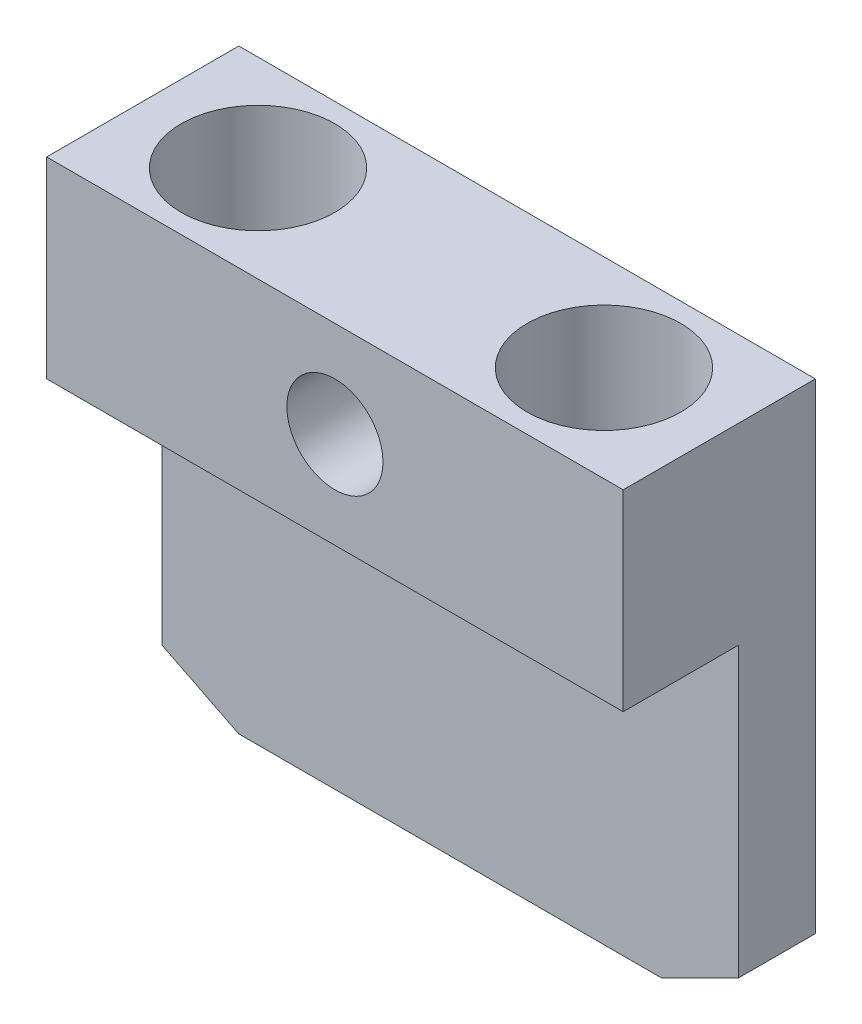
ISO-10303-21;
HEADER;
FILE_DESCRIPTION(('STEP AP214'),'2;1');
FILE_NAME('part.step','',(''),(''),'','','');
FILE_SCHEMA(('AUTOMOTIVE_DESIGN { 1 0 10303 214 1 1 1 1 }'));
ENDSEC;
DATA;
#1=APPLICATION_CONTEXT('core data for automotive mechanical design processes');
#2=APPLICATION_PROTOCOL_DEFINITION('international standard','automotive_design',2000,#1);
#3=PRODUCT_CONTEXT('',#1,'mechanical');
#4=PRODUCT('Part','Part','',(#3));
#5=PRODUCT_RELATED_PRODUCT_CATEGORY('part','',(#4));
#6=PRODUCT_DEFINITION_FORMATION('','',#4);
#7=PRODUCT_DEFINITION_CONTEXT('part definition',#1,'design');
#8=PRODUCT_DEFINITION('design','',#6,#7);
#9=PRODUCT_DEFINITION_SHAPE('','',#8);
#10=(LENGTH_UNIT() NAMED_UNIT(*) SI_UNIT(.MILLI.,.METRE.));
#11=(NAMED_UNIT(*) PLANE_ANGLE_UNIT() SI_UNIT($,.RADIAN.));
#12=(NAMED_UNIT(*) SI_UNIT($,.STERADIAN.) SOLID_ANGLE_UNIT());
#13=UNCERTAINTY_MEASURE_WITH_UNIT(LENGTH_MEASURE(1.E-05),#10,'distance_accuracy_value','');
#14=(GEOMETRIC_REPRESENTATION_CONTEXT(3) GLOBAL_UNCERTAINTY_ASSIGNED_CONTEXT((#13)) GLOBAL_UNIT_ASSIGNED_CONTEXT((#10,
#11,#12)) REPRESENTATION_CONTEXT('',''));
#15=CARTESIAN_POINT('',(0.,0.,0.));
#16=DIRECTION('',(0.,0.,1.));
#17=DIRECTION('',(1.,0.,0.));
#18=AXIS2_PLACEMENT_3D('',#15,#16,#17);
#19=CARTESIAN_POINT('',(0.,1.,5.));
#20=DIRECTION('',(0.,0.,-1.));
#21=DIRECTION('',(-1.,0.,0.));
#22=AXIS2_PLACEMENT_3D('',#19,#20,#21);
#23=PLANE('',#22);
#24=CARTESIAN_POINT('',(7.5,11.,5.));
#25=DIRECTION('',(0.,0.,1.));
#26=DIRECTION('',(1.,0.,0.));
#27=AXIS2_PLACEMENT_3D('',#24,#25,#26);
#28=CIRCLE('',#27,1.25);
#29=CARTESIAN_POINT('',(8.75,11.,5.));
#30=VERTEX_POINT('',#29);
#31=EDGE_CURVE('E146',#30,#30,#28,.T.);
#32=ORIENTED_EDGE('',*,*,#31,.F.);
#33=EDGE_LOOP('',(#32));
#34=FACE_BOUND('',#33,.T.);
#35=DIRECTION('',(-1.,0.,0.));
#36=VECTOR('',#35,1.);
#37=CARTESIAN_POINT('',(57.2382786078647,8.5,5.));
#38=LINE('',#37,#36);
#39=CARTESIAN_POINT('',(15.,8.5,5.));
#40=VERTEX_POINT('',#39);
#41=CARTESIAN_POINT('',(0.,8.5,5.));
#42=VERTEX_POINT('',#41);
#43=EDGE_CURVE('E115',#40,#42,#38,.T.);
#44=ORIENTED_EDGE('',*,*,#43,.F.);
#45=DIRECTION('',(0.,1.,0.));
#46=VECTOR('',#45,1.);
#47=CARTESIAN_POINT('',(15.,1.,5.));
#48=LINE('',#47,#46);
#49=CARTESIAN_POINT('',(15.,13.5,5.));
#50=VERTEX_POINT('',#49);
#51=EDGE_CURVE('E133',#40,#50,#48,.T.);
#52=ORIENTED_EDGE('',*,*,#51,.T.);
#53=DIRECTION('',(-1.,0.,0.));
#54=VECTOR('',#53,1.);
#55=CARTESIAN_POINT('',(0.,13.5,5.));
#56=LINE('',#55,#54);
#57=CARTESIAN_POINT('',(0.,13.5,5.));
#58=VERTEX_POINT('',#57);
#59=EDGE_CURVE('E149',#50,#58,#56,.T.);
#60=ORIENTED_EDGE('',*,*,#59,.T.);
#61=DIRECTION('',(0.,-1.,0.));
#62=VECTOR('',#61,1.);
#63=CARTESIAN_POINT('',(0.,1.,5.));
#64=LINE('',#63,#62);
#65=EDGE_CURVE('E108',#58,#42,#64,.T.);
#66=ORIENTED_EDGE('',*,*,#65,.T.);
#67=EDGE_LOOP('',(#44,#52,#60,#66));
#68=FACE_BOUND('',#67,.T.);
#69=ADVANCED_FACE('F32',(#34,#68),#23,.F.);
#70=CARTESIAN_POINT('',(2.,0.,5.));
#71=DIRECTION('',(0.447213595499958,0.894427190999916,0.));
#72=DIRECTION('',(-0.894427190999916,0.447213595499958,0.));
#73=AXIS2_PLACEMENT_3D('',#70,#71,#72);
#74=PLANE('',#73);
#75=DIRECTION('',(0.894427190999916,-0.447213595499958,0.));
#76=VECTOR('',#75,1.);
#77=CARTESIAN_POINT('',(2.,0.,2.));
#78=LINE('',#77,#76);
#79=CARTESIAN_POINT('',(0.,1.,2.));
#80=VERTEX_POINT('',#79);
#81=CARTESIAN_POINT('',(2.,0.,2.));
#82=VERTEX_POINT('',#81);
#83=EDGE_CURVE('E111',#80,#82,#78,.T.);
#84=ORIENTED_EDGE('',*,*,#83,.F.);
#85=DIRECTION('',(0.,0.,-1.));
#86=VECTOR('',#85,1.);
#87=CARTESIAN_POINT('',(0.,1.,5.));
#88=LINE('',#87,#86);
#89=CARTESIAN_POINT('',(0.,1.,0.));
#90=VERTEX_POINT('',#89);
#91=EDGE_CURVE('E97',#80,#90,#88,.T.);
#92=ORIENTED_EDGE('',*,*,#91,.T.);
#93=DIRECTION('',(0.894427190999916,-0.447213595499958,0.));
#94=VECTOR('',#93,1.);
#95=CARTESIAN_POINT('',(2.,0.,0.));
#96=LINE('',#95,#94);
#97=CARTESIAN_POINT('',(2.,0.,0.));
#98=VERTEX_POINT('',#97);
#99=EDGE_CURVE('E144',#90,#98,#96,.T.);
#100=ORIENTED_EDGE('',*,*,#99,.T.);
#101=DIRECTION('',(0.,0.,-1.));
#102=VECTOR('',#101,1.);
#103=CARTESIAN_POINT('',(2.,0.,5.));
#104=LINE('',#103,#102);
#105=EDGE_CURVE('E112',#82,#98,#104,.T.);
#106=ORIENTED_EDGE('',*,*,#105,.F.);
#107=EDGE_LOOP('',(#84,#92,#100,#106));
#108=FACE_BOUND('',#107,.T.);
#109=ADVANCED_FACE('F34',(#108),#74,.F.);
#110=CARTESIAN_POINT('',(2.,0.,5.));
#111=DIRECTION('',(0.,1.,0.));
#112=DIRECTION('',(0.,0.,1.));
#113=AXIS2_PLACEMENT_3D('',#110,#111,#112);
#114=PLANE('',#113);
#115=DIRECTION('',(-1.,0.,0.));
#116=VECTOR('',#115,1.);
#117=CARTESIAN_POINT('',(57.2382786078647,0.,2.));
#118=LINE('',#117,#116);
#119=CARTESIAN_POINT('',(13.,0.,2.));
#120=VERTEX_POINT('',#119);
#121=EDGE_CURVE('E47',#120,#82,#118,.T.);
#122=ORIENTED_EDGE('',*,*,#121,.T.);
#123=ORIENTED_EDGE('',*,*,#105,.T.);
#124=DIRECTION('',(1.,0.,0.));
#125=VECTOR('',#124,1.);
#126=CARTESIAN_POINT('',(2.,0.,0.));
#127=LINE('',#126,#125);
#128=CARTESIAN_POINT('',(13.,0.,0.));
#129=VERTEX_POINT('',#128);
#130=EDGE_CURVE('E141',#98,#129,#127,.T.);
#131=ORIENTED_EDGE('',*,*,#130,.T.);
#132=DIRECTION('',(0.,0.,-1.));
#133=VECTOR('',#132,1.);
#134=CARTESIAN_POINT('',(13.,0.,5.));
#135=LINE('',#134,#133);
#136=EDGE_CURVE('E122',#120,#129,#135,.T.);
#137=ORIENTED_EDGE('',*,*,#136,.F.);
#138=EDGE_LOOP('',(#122,#123,#131,#137));
#139=FACE_BOUND('',#138,.T.);
#140=ADVANCED_FACE('F206',(#139),#114,.F.);
#141=CARTESIAN_POINT('',(13.,0.,5.));
#142=DIRECTION('',(-0.447213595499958,0.894427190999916,0.));
#143=DIRECTION('',(-0.894427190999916,-0.447213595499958,0.));
#144=AXIS2_PLACEMENT_3D('',#141,#142,#143);
#145=PLANE('',#144);
#146=DIRECTION('',(0.894427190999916,0.447213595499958,0.));
#147=VECTOR('',#146,1.);
#148=CARTESIAN_POINT('',(13.,0.,2.));
#149=LINE('',#148,#147);
#150=CARTESIAN_POINT('',(15.,1.,2.));
#151=VERTEX_POINT('',#150);
#152=EDGE_CURVE('E55',#120,#151,#149,.T.);
#153=ORIENTED_EDGE('',*,*,#152,.F.);
#154=ORIENTED_EDGE('',*,*,#136,.T.);
#155=DIRECTION('',(0.894427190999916,0.447213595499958,0.));
#156=VECTOR('',#155,1.);
#157=CARTESIAN_POINT('',(13.,0.,0.));
#158=LINE('',#157,#156);
#159=CARTESIAN_POINT('',(15.,1.,0.));
#160=VERTEX_POINT('',#159);
#161=EDGE_CURVE('E138',#129,#160,#158,.T.);
#162=ORIENTED_EDGE('',*,*,#161,.T.);
#163=DIRECTION('',(0.,0.,-1.));
#164=VECTOR('',#163,1.);
#165=CARTESIAN_POINT('',(15.,1.,5.));
#166=LINE('',#165,#164);
#167=EDGE_CURVE('E126',#151,#160,#166,.T.);
#168=ORIENTED_EDGE('',*,*,#167,.F.);
#169=EDGE_LOOP('',(#153,#154,#162,#168));
#170=FACE_BOUND('',#169,.T.);
#171=ADVANCED_FACE('F213',(#170),#145,.F.);
#172=CARTESIAN_POINT('',(15.,1.,5.));
#173=DIRECTION('',(-1.,0.,0.));
#174=DIRECTION('',(0.,0.,1.));
#175=AXIS2_PLACEMENT_3D('',#172,#173,#174);
#176=PLANE('',#175);
#177=DIRECTION('',(0.,0.,1.));
#178=VECTOR('',#177,1.);
#179=CARTESIAN_POINT('',(15.,8.5,5.));
#180=LINE('',#179,#178);
#181=CARTESIAN_POINT('',(15.,8.5,2.));
#182=VERTEX_POINT('',#181);
#183=EDGE_CURVE('E155',#182,#40,#180,.T.);
#184=ORIENTED_EDGE('',*,*,#183,.F.);
#185=DIRECTION('',(0.,1.,0.));
#186=VECTOR('',#185,1.);
#187=CARTESIAN_POINT('',(15.,1.,2.));
#188=LINE('',#187,#186);
#189=EDGE_CURVE('E114',#151,#182,#188,.T.);
#190=ORIENTED_EDGE('',*,*,#189,.F.);
#191=ORIENTED_EDGE('',*,*,#167,.T.);
#192=DIRECTION('',(0.,1.,0.));
#193=VECTOR('',#192,1.);
#194=CARTESIAN_POINT('',(15.,1.,0.));
#195=LINE('',#194,#193);
#196=CARTESIAN_POINT('',(15.,13.5,0.));
#197=VERTEX_POINT('',#196);
#198=EDGE_CURVE('E136',#160,#197,#195,.T.);
#199=ORIENTED_EDGE('',*,*,#198,.T.);
#200=DIRECTION('',(0.,0.,-1.));
#201=VECTOR('',#200,1.);
#202=CARTESIAN_POINT('',(15.,13.5,5.));
#203=LINE('',#202,#201);
#204=EDGE_CURVE('E128',#50,#197,#203,.T.);
#205=ORIENTED_EDGE('',*,*,#204,.F.);
#206=ORIENTED_EDGE('',*,*,#51,.F.);
#207=EDGE_LOOP('',(#184,#190,#191,#199,#205,#206));
#208=FACE_BOUND('',#207,.T.);
#209=ADVANCED_FACE('F212',(#208),#176,.F.);
#210=CARTESIAN_POINT('',(0.,1.,5.));
#211=DIRECTION('',(1.,0.,0.));
#212=DIRECTION('',(0.,0.,-1.));
#213=AXIS2_PLACEMENT_3D('',#210,#211,#212);
#214=PLANE('',#213);
#215=DIRECTION('',(0.,0.,-1.));
#216=VECTOR('',#215,1.);
#217=CARTESIAN_POINT('',(0.,8.5,5.));
#218=LINE('',#217,#216);
#219=CARTESIAN_POINT('',(0.,8.5,2.));
#220=VERTEX_POINT('',#219);
#221=EDGE_CURVE('E11',#42,#220,#218,.T.);
#222=ORIENTED_EDGE('',*,*,#221,.F.);
#223=ORIENTED_EDGE('',*,*,#65,.F.);
#224=DIRECTION('',(0.,0.,-1.));
#225=VECTOR('',#224,1.);
#226=CARTESIAN_POINT('',(0.,13.5,5.));
#227=LINE('',#226,#225);
#228=CARTESIAN_POINT('',(0.,13.5,0.));
#229=VERTEX_POINT('',#228);
#230=EDGE_CURVE('E107',#58,#229,#227,.T.);
#231=ORIENTED_EDGE('',*,*,#230,.T.);
#232=DIRECTION('',(0.,-1.,0.));
#233=VECTOR('',#232,1.);
#234=CARTESIAN_POINT('',(0.,1.,0.));
#235=LINE('',#234,#233);
#236=EDGE_CURVE('E103',#229,#90,#235,.T.);
#237=ORIENTED_EDGE('',*,*,#236,.T.);
#238=ORIENTED_EDGE('',*,*,#91,.F.);
#239=DIRECTION('',(0.,-1.,0.));
#240=VECTOR('',#239,1.);
#241=CARTESIAN_POINT('',(0.,1.,2.));
#242=LINE('',#241,#240);
#243=EDGE_CURVE('E40',#220,#80,#242,.T.);
#244=ORIENTED_EDGE('',*,*,#243,.F.);
#245=EDGE_LOOP('',(#222,#223,#231,#237,#238,#244));
#246=FACE_BOUND('',#245,.T.);
#247=ADVANCED_FACE('F99',(#246),#214,.F.);
#248=CARTESIAN_POINT('',(0.,1.,0.));
#249=DIRECTION('',(0.,0.,-1.));
#250=DIRECTION('',(-1.,0.,0.));
#251=AXIS2_PLACEMENT_3D('',#248,#249,#250);
#252=PLANE('',#251);
#253=ORIENTED_EDGE('',*,*,#99,.F.);
#254=ORIENTED_EDGE('',*,*,#236,.F.);
#255=DIRECTION('',(-1.,0.,0.));
#256=VECTOR('',#255,1.);
#257=CARTESIAN_POINT('',(0.,13.5,0.));
#258=LINE('',#257,#256);
#259=EDGE_CURVE('E134',#197,#229,#258,.T.);
#260=ORIENTED_EDGE('',*,*,#259,.F.);
#261=ORIENTED_EDGE('',*,*,#198,.F.);
#262=ORIENTED_EDGE('',*,*,#161,.F.);
#263=ORIENTED_EDGE('',*,*,#130,.F.);
#264=EDGE_LOOP('',(#253,#254,#260,#261,#262,#263));
#265=FACE_BOUND('',#264,.T.);
#266=CARTESIAN_POINT('',(7.5,11.,0.));
#267=DIRECTION('',(0.,0.,1.));
#268=DIRECTION('',(1.,0.,0.));
#269=AXIS2_PLACEMENT_3D('',#266,#267,#268);
#270=CIRCLE('',#269,1.25);
#271=CARTESIAN_POINT('',(8.75,11.,0.));
#272=VERTEX_POINT('',#271);
#273=EDGE_CURVE('E152',#272,#272,#270,.T.);
#274=ORIENTED_EDGE('',*,*,#273,.T.);
#275=EDGE_LOOP('',(#274));
#276=FACE_BOUND('',#275,.T.);
#277=ADVANCED_FACE('F192',(#265,#276),#252,.T.);
#278=CARTESIAN_POINT('',(0.,13.5,5.));
#279=DIRECTION('',(0.,-1.,0.));
#280=DIRECTION('',(0.,0.,-1.));
#281=AXIS2_PLACEMENT_3D('',#278,#279,#280);
#282=PLANE('',#281);
#283=CARTESIAN_POINT('',(3.,13.5,2.5));
#284=DIRECTION('',(0.,1.,0.));
#285=DIRECTION('',(0.,0.,1.));
#286=AXIS2_PLACEMENT_3D('',#283,#284,#285);
#287=CIRCLE('',#286,2.);
#288=CARTESIAN_POINT('',(3.,13.5,4.5));
#289=VERTEX_POINT('',#288);
#290=EDGE_CURVE('E173',#289,#289,#287,.T.);
#291=ORIENTED_EDGE('',*,*,#290,.F.);
#292=EDGE_LOOP('',(#291));
#293=FACE_BOUND('',#292,.T.);
#294=CARTESIAN_POINT('',(12.,13.5,2.5));
#295=DIRECTION('',(0.,1.,0.));
#296=DIRECTION('',(0.,0.,1.));
#297=AXIS2_PLACEMENT_3D('',#294,#295,#296);
#298=CIRCLE('',#297,2.);
#299=CARTESIAN_POINT('',(12.,13.5,4.5));
#300=VERTEX_POINT('',#299);
#301=EDGE_CURVE('E167',#300,#300,#298,.T.);
#302=ORIENTED_EDGE('',*,*,#301,.F.);
#303=EDGE_LOOP('',(#302));
#304=FACE_BOUND('',#303,.T.);
#305=ORIENTED_EDGE('',*,*,#259,.T.);
#306=ORIENTED_EDGE('',*,*,#230,.F.);
#307=ORIENTED_EDGE('',*,*,#59,.F.);
#308=ORIENTED_EDGE('',*,*,#204,.T.);
#309=EDGE_LOOP('',(#305,#306,#307,#308));
#310=FACE_BOUND('',#309,.T.);
#311=ADVANCED_FACE('F188',(#293,#304,#310),#282,.F.);
#312=CARTESIAN_POINT('',(7.5,11.,5.));
#313=DIRECTION('',(0.,0.,-1.));
#314=DIRECTION('',(-1.,0.,0.));
#315=AXIS2_PLACEMENT_3D('',#312,#313,#314);
#316=CYLINDRICAL_SURFACE('',#315,1.25);
#317=ORIENTED_EDGE('',*,*,#31,.T.);
#318=EDGE_LOOP('',(#317));
#319=FACE_BOUND('',#318,.T.);
#320=ORIENTED_EDGE('',*,*,#273,.F.);
#321=EDGE_LOOP('',(#320));
#322=FACE_BOUND('',#321,.T.);
#323=ADVANCED_FACE('F191',(#319,#322),#316,.F.);
#324=CARTESIAN_POINT('',(57.2382786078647,8.5,5.));
#325=DIRECTION('',(0.,-1.,0.));
#326=DIRECTION('',(0.,0.,-1.));
#327=AXIS2_PLACEMENT_3D('',#324,#325,#326);
#328=PLANE('',#327);
#329=DIRECTION('',(-1.,0.,0.));
#330=VECTOR('',#329,1.);
#331=CARTESIAN_POINT('',(57.2382786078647,8.5,2.));
#332=LINE('',#331,#330);
#333=EDGE_CURVE('E121',#182,#220,#332,.T.);
#334=ORIENTED_EDGE('',*,*,#333,.F.);
#335=ORIENTED_EDGE('',*,*,#183,.T.);
#336=ORIENTED_EDGE('',*,*,#43,.T.);
#337=ORIENTED_EDGE('',*,*,#221,.T.);
#338=EDGE_LOOP('',(#334,#335,#336,#337));
#339=FACE_BOUND('',#338,.T.);
#340=ADVANCED_FACE('F209',(#339),#328,.T.);
#341=CARTESIAN_POINT('',(57.2382786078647,0.,2.));
#342=DIRECTION('',(0.,0.,1.));
#343=DIRECTION('',(1.,0.,0.));
#344=AXIS2_PLACEMENT_3D('',#341,#342,#343);
#345=PLANE('',#344);
#346=ORIENTED_EDGE('',*,*,#121,.F.);
#347=ORIENTED_EDGE('',*,*,#152,.T.);
#348=ORIENTED_EDGE('',*,*,#189,.T.);
#349=ORIENTED_EDGE('',*,*,#333,.T.);
#350=ORIENTED_EDGE('',*,*,#243,.T.);
#351=ORIENTED_EDGE('',*,*,#83,.T.);
#352=EDGE_LOOP('',(#346,#347,#348,#349,#350,#351));
#353=FACE_BOUND('',#352,.T.);
#354=ADVANCED_FACE('F118',(#353),#345,.T.);
#355=CARTESIAN_POINT('',(12.,10.5,2.5));
#356=DIRECTION('',(0.,1.,0.));
#357=DIRECTION('',(0.,0.,1.));
#358=AXIS2_PLACEMENT_3D('',#355,#356,#357);
#359=CYLINDRICAL_SURFACE('',#358,2.);
#360=CARTESIAN_POINT('',(12.,10.5,2.5));
#361=DIRECTION('',(0.,1.,0.));
#362=DIRECTION('',(0.,0.,1.));
#363=AXIS2_PLACEMENT_3D('',#360,#361,#362);
#364=CIRCLE('',#363,2.);
#365=CARTESIAN_POINT('',(12.,10.5,4.5));
#366=VERTEX_POINT('',#365);
#367=EDGE_CURVE('E166',#366,#366,#364,.T.);
#368=ORIENTED_EDGE('',*,*,#367,.F.);
#369=EDGE_LOOP('',(#368));
#370=FACE_BOUND('',#369,.T.);
#371=ORIENTED_EDGE('',*,*,#301,.T.);
#372=EDGE_LOOP('',(#371));
#373=FACE_BOUND('',#372,.T.);
#374=ADVANCED_FACE('F264',(#370,#373),#359,.F.);
#375=CARTESIAN_POINT('',(12.,10.5,2.5));
#376=DIRECTION('',(0.,1.,0.));
#377=DIRECTION('',(0.,0.,1.));
#378=AXIS2_PLACEMENT_3D('',#375,#376,#377);
#379=PLANE('',#378);
#380=ORIENTED_EDGE('',*,*,#367,.T.);
#381=EDGE_LOOP('',(#380));
#382=FACE_BOUND('',#381,.T.);
#383=ADVANCED_FACE('F184',(#382),#379,.T.);
#384=CARTESIAN_POINT('',(3.,10.5,2.5));
#385=DIRECTION('',(0.,1.,0.));
#386=DIRECTION('',(0.,0.,1.));
#387=AXIS2_PLACEMENT_3D('',#384,#385,#386);
#388=CYLINDRICAL_SURFACE('',#387,2.);
#389=CARTESIAN_POINT('',(3.,10.5,2.5));
#390=DIRECTION('',(0.,1.,0.));
#391=DIRECTION('',(0.,0.,1.));
#392=AXIS2_PLACEMENT_3D('',#389,#390,#391);
#393=CIRCLE('',#392,2.);
#394=CARTESIAN_POINT('',(3.,10.5,4.5));
#395=VERTEX_POINT('',#394);
#396=EDGE_CURVE('E170',#395,#395,#393,.T.);
#397=ORIENTED_EDGE('',*,*,#396,.F.);
#398=EDGE_LOOP('',(#397));
#399=FACE_BOUND('',#398,.T.);
#400=ORIENTED_EDGE('',*,*,#290,.T.);
#401=EDGE_LOOP('',(#400));
#402=FACE_BOUND('',#401,.T.);
#403=ADVANCED_FACE('F181',(#399,#402),#388,.F.);
#404=CARTESIAN_POINT('',(3.,10.5,2.5));
#405=DIRECTION('',(0.,1.,0.));
#406=DIRECTION('',(0.,0.,1.));
#407=AXIS2_PLACEMENT_3D('',#404,#405,#406);
#408=PLANE('',#407);
#409=ORIENTED_EDGE('',*,*,#396,.T.);
#410=EDGE_LOOP('',(#409));
#411=FACE_BOUND('',#410,.T.);
#412=ADVANCED_FACE('F179',(#411),#408,.T.);
#413=CLOSED_SHELL('',(#69,#109,#140,#171,#209,#247,#277,#311,#323,#340,#354,#374,#383,#403,#412));
#414=MANIFOLD_SOLID_BREP('B2',#413);
#415=ADVANCED_BREP_SHAPE_REPRESENTATION('',(#18,#414),#14);
#416=SHAPE_DEFINITION_REPRESENTATION(#9,#415);
ENDSEC;
END-ISO-10303-21;
